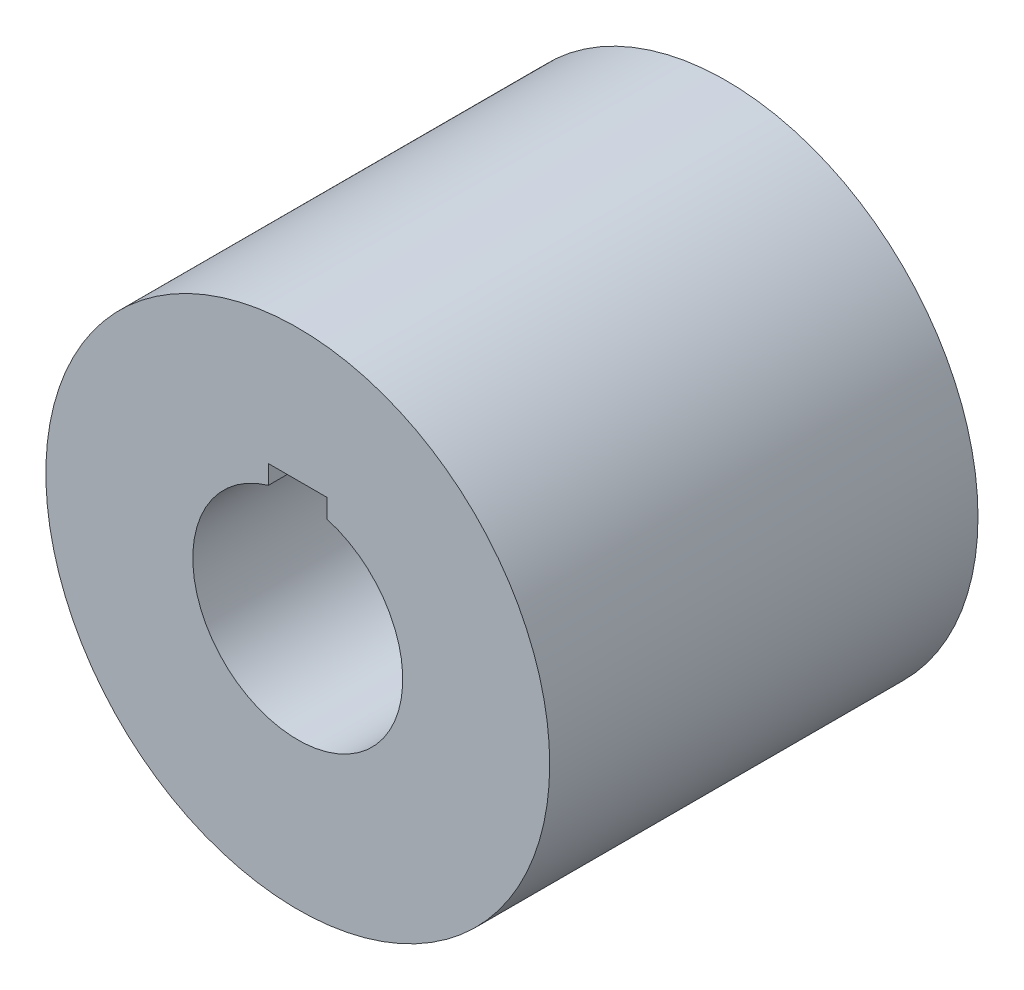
ISO-10303-21;
HEADER;
FILE_DESCRIPTION(('STEP AP214'),'2;1');
FILE_NAME('part.step','',(''),(''),'','','');
FILE_SCHEMA(('AUTOMOTIVE_DESIGN { 1 0 10303 214 1 1 1 1 }'));
ENDSEC;
DATA;
#1=APPLICATION_CONTEXT('core data for automotive mechanical design processes');
#2=APPLICATION_PROTOCOL_DEFINITION('international standard','automotive_design',2000,#1);
#3=PRODUCT_CONTEXT('',#1,'mechanical');
#4=PRODUCT('Part','Part','',(#3));
#5=PRODUCT_RELATED_PRODUCT_CATEGORY('part','',(#4));
#6=PRODUCT_DEFINITION_FORMATION('','',#4);
#7=PRODUCT_DEFINITION_CONTEXT('part definition',#1,'design');
#8=PRODUCT_DEFINITION('design','',#6,#7);
#9=PRODUCT_DEFINITION_SHAPE('','',#8);
#10=(LENGTH_UNIT() NAMED_UNIT(*) SI_UNIT(.MILLI.,.METRE.));
#11=(NAMED_UNIT(*) PLANE_ANGLE_UNIT() SI_UNIT($,.RADIAN.));
#12=(NAMED_UNIT(*) SI_UNIT($,.STERADIAN.) SOLID_ANGLE_UNIT());
#13=UNCERTAINTY_MEASURE_WITH_UNIT(LENGTH_MEASURE(1.E-05),#10,'distance_accuracy_value','');
#14=(GEOMETRIC_REPRESENTATION_CONTEXT(3) GLOBAL_UNCERTAINTY_ASSIGNED_CONTEXT((#13)) GLOBAL_UNIT_ASSIGNED_CONTEXT((#10,
#11,#12)) REPRESENTATION_CONTEXT('',''));
#15=CARTESIAN_POINT('',(0.,0.,0.));
#16=DIRECTION('',(0.,0.,1.));
#17=DIRECTION('',(1.,0.,0.));
#18=AXIS2_PLACEMENT_3D('',#15,#16,#17);
#19=CARTESIAN_POINT('',(0.,0.,51.));
#20=DIRECTION('',(0.,0.,-1.));
#21=DIRECTION('',(-1.,0.,0.));
#22=AXIS2_PLACEMENT_3D('',#19,#20,#21);
#23=CYLINDRICAL_SURFACE('',#22,60.);
#24=CARTESIAN_POINT('',(0.,0.,51.));
#25=DIRECTION('',(0.,0.,1.));
#26=DIRECTION('',(1.,0.,0.));
#27=AXIS2_PLACEMENT_3D('',#24,#25,#26);
#28=CIRCLE('',#27,60.);
#29=CARTESIAN_POINT('',(60.,0.,51.));
#30=VERTEX_POINT('',#29);
#31=EDGE_CURVE('E11',#30,#30,#28,.T.);
#32=ORIENTED_EDGE('',*,*,#31,.F.);
#33=EDGE_LOOP('',(#32));
#34=FACE_BOUND('',#33,.T.);
#35=CARTESIAN_POINT('',(0.,0.,-51.));
#36=DIRECTION('',(0.,0.,1.));
#37=DIRECTION('',(1.,0.,0.));
#38=AXIS2_PLACEMENT_3D('',#35,#36,#37);
#39=CIRCLE('',#38,60.);
#40=CARTESIAN_POINT('',(60.,0.,-51.));
#41=VERTEX_POINT('',#40);
#42=EDGE_CURVE('E42',#41,#41,#39,.T.);
#43=ORIENTED_EDGE('',*,*,#42,.T.);
#44=EDGE_LOOP('',(#43));
#45=FACE_BOUND('',#44,.T.);
#46=ADVANCED_FACE('F35',(#34,#45),#23,.T.);
#47=CARTESIAN_POINT('',(0.,0.,51.));
#48=DIRECTION('',(0.,0.,1.));
#49=DIRECTION('',(1.,0.,0.));
#50=AXIS2_PLACEMENT_3D('',#47,#48,#49);
#51=PLANE('',#50);
#52=DIRECTION('',(0.,1.,0.));
#53=VECTOR('',#52,1.);
#54=CARTESIAN_POINT('',(7.,28.5,51.));
#55=LINE('',#54,#53);
#56=CARTESIAN_POINT('',(7.00000000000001,24.,51.));
#57=VERTEX_POINT('',#56);
#58=CARTESIAN_POINT('',(7.,28.5,51.));
#59=VERTEX_POINT('',#58);
#60=EDGE_CURVE('E49',#57,#59,#55,.T.);
#61=ORIENTED_EDGE('',*,*,#60,.F.);
#62=CARTESIAN_POINT('',(0.,0.,51.));
#63=DIRECTION('',(0.,0.,1.));
#64=DIRECTION('',(1.,0.,0.));
#65=AXIS2_PLACEMENT_3D('',#62,#63,#64);
#66=CIRCLE('',#65,25.);
#67=CARTESIAN_POINT('',(-7.,24.,51.));
#68=VERTEX_POINT('',#67);
#69=EDGE_CURVE('E93',#68,#57,#66,.T.);
#70=ORIENTED_EDGE('',*,*,#69,.F.);
#71=DIRECTION('',(0.,-1.,0.));
#72=VECTOR('',#71,1.);
#73=CARTESIAN_POINT('',(-7.,28.5,51.));
#74=LINE('',#73,#72);
#75=CARTESIAN_POINT('',(-7.,28.5,51.));
#76=VERTEX_POINT('',#75);
#77=EDGE_CURVE('E77',#76,#68,#74,.T.);
#78=ORIENTED_EDGE('',*,*,#77,.F.);
#79=DIRECTION('',(-1.,0.,0.));
#80=VECTOR('',#79,1.);
#81=CARTESIAN_POINT('',(7.,28.5,51.));
#82=LINE('',#81,#80);
#83=EDGE_CURVE('E86',#59,#76,#82,.T.);
#84=ORIENTED_EDGE('',*,*,#83,.F.);
#85=EDGE_LOOP('',(#61,#70,#78,#84));
#86=FACE_BOUND('',#85,.T.);
#87=ORIENTED_EDGE('',*,*,#31,.T.);
#88=EDGE_LOOP('',(#87));
#89=FACE_BOUND('',#88,.T.);
#90=ADVANCED_FACE('F90',(#86,#89),#51,.T.);
#91=CARTESIAN_POINT('',(0.,0.,-51.));
#92=DIRECTION('',(0.,0.,1.));
#93=DIRECTION('',(1.,0.,0.));
#94=AXIS2_PLACEMENT_3D('',#91,#92,#93);
#95=PLANE('',#94);
#96=CARTESIAN_POINT('',(0.,0.,-51.));
#97=DIRECTION('',(0.,0.,1.));
#98=DIRECTION('',(1.,0.,0.));
#99=AXIS2_PLACEMENT_3D('',#96,#97,#98);
#100=CIRCLE('',#99,25.);
#101=CARTESIAN_POINT('',(-7.,24.,-51.));
#102=VERTEX_POINT('',#101);
#103=CARTESIAN_POINT('',(7.00000000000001,24.,-51.));
#104=VERTEX_POINT('',#103);
#105=EDGE_CURVE('E104',#102,#104,#100,.T.);
#106=ORIENTED_EDGE('',*,*,#105,.T.);
#107=DIRECTION('',(0.,1.,0.));
#108=VECTOR('',#107,1.);
#109=CARTESIAN_POINT('',(7.,28.5,-51.));
#110=LINE('',#109,#108);
#111=CARTESIAN_POINT('',(7.,28.5,-51.));
#112=VERTEX_POINT('',#111);
#113=EDGE_CURVE('E95',#104,#112,#110,.T.);
#114=ORIENTED_EDGE('',*,*,#113,.T.);
#115=DIRECTION('',(-1.,0.,0.));
#116=VECTOR('',#115,1.);
#117=CARTESIAN_POINT('',(7.,28.5,-51.));
#118=LINE('',#117,#116);
#119=CARTESIAN_POINT('',(-7.,28.5,-51.));
#120=VERTEX_POINT('',#119);
#121=EDGE_CURVE('E101',#112,#120,#118,.T.);
#122=ORIENTED_EDGE('',*,*,#121,.T.);
#123=DIRECTION('',(0.,-1.,0.));
#124=VECTOR('',#123,1.);
#125=CARTESIAN_POINT('',(-7.,28.5,-51.));
#126=LINE('',#125,#124);
#127=EDGE_CURVE('E57',#120,#102,#126,.T.);
#128=ORIENTED_EDGE('',*,*,#127,.T.);
#129=EDGE_LOOP('',(#106,#114,#122,#128));
#130=FACE_BOUND('',#129,.T.);
#131=ORIENTED_EDGE('',*,*,#42,.F.);
#132=EDGE_LOOP('',(#131));
#133=FACE_BOUND('',#132,.T.);
#134=ADVANCED_FACE('F114',(#130,#133),#95,.F.);
#135=CARTESIAN_POINT('',(7.,28.5,-51.));
#136=DIRECTION('',(1.,0.,0.));
#137=DIRECTION('',(0.,1.,0.));
#138=AXIS2_PLACEMENT_3D('',#135,#136,#137);
#139=PLANE('',#138);
#140=ORIENTED_EDGE('',*,*,#60,.T.);
#141=DIRECTION('',(0.,0.,1.));
#142=VECTOR('',#141,1.);
#143=CARTESIAN_POINT('',(7.,28.5,-51.));
#144=LINE('',#143,#142);
#145=EDGE_CURVE('E83',#112,#59,#144,.T.);
#146=ORIENTED_EDGE('',*,*,#145,.F.);
#147=ORIENTED_EDGE('',*,*,#113,.F.);
#148=DIRECTION('',(0.,0.,1.));
#149=VECTOR('',#148,1.);
#150=CARTESIAN_POINT('',(7.00000000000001,24.,-51.));
#151=LINE('',#150,#149);
#152=EDGE_CURVE('E107',#104,#57,#151,.T.);
#153=ORIENTED_EDGE('',*,*,#152,.T.);
#154=EDGE_LOOP('',(#140,#146,#147,#153));
#155=FACE_BOUND('',#154,.T.);
#156=ADVANCED_FACE('F116',(#155),#139,.F.);
#157=CARTESIAN_POINT('',(0.,0.,-51.));
#158=DIRECTION('',(0.,0.,1.));
#159=DIRECTION('',(1.,0.,0.));
#160=AXIS2_PLACEMENT_3D('',#157,#158,#159);
#161=CYLINDRICAL_SURFACE('',#160,25.);
#162=ORIENTED_EDGE('',*,*,#69,.T.);
#163=ORIENTED_EDGE('',*,*,#152,.F.);
#164=ORIENTED_EDGE('',*,*,#105,.F.);
#165=DIRECTION('',(0.,0.,1.));
#166=VECTOR('',#165,1.);
#167=CARTESIAN_POINT('',(-7.,24.,-51.));
#168=LINE('',#167,#166);
#169=EDGE_CURVE('E82',#102,#68,#168,.T.);
#170=ORIENTED_EDGE('',*,*,#169,.T.);
#171=EDGE_LOOP('',(#162,#163,#164,#170));
#172=FACE_BOUND('',#171,.T.);
#173=ADVANCED_FACE('F123',(#172),#161,.F.);
#174=CARTESIAN_POINT('',(-7.,28.5,-51.));
#175=DIRECTION('',(-1.,0.,0.));
#176=DIRECTION('',(0.,-1.,0.));
#177=AXIS2_PLACEMENT_3D('',#174,#175,#176);
#178=PLANE('',#177);
#179=ORIENTED_EDGE('',*,*,#77,.T.);
#180=ORIENTED_EDGE('',*,*,#169,.F.);
#181=ORIENTED_EDGE('',*,*,#127,.F.);
#182=DIRECTION('',(0.,0.,1.));
#183=VECTOR('',#182,1.);
#184=CARTESIAN_POINT('',(-7.,28.5,-51.));
#185=LINE('',#184,#183);
#186=EDGE_CURVE('E73',#120,#76,#185,.T.);
#187=ORIENTED_EDGE('',*,*,#186,.T.);
#188=EDGE_LOOP('',(#179,#180,#181,#187));
#189=FACE_BOUND('',#188,.T.);
#190=ADVANCED_FACE('F75',(#189),#178,.F.);
#191=CARTESIAN_POINT('',(7.,28.5,-51.));
#192=DIRECTION('',(0.,1.,0.));
#193=DIRECTION('',(0.,0.,1.));
#194=AXIS2_PLACEMENT_3D('',#191,#192,#193);
#195=PLANE('',#194);
#196=ORIENTED_EDGE('',*,*,#83,.T.);
#197=ORIENTED_EDGE('',*,*,#186,.F.);
#198=ORIENTED_EDGE('',*,*,#121,.F.);
#199=ORIENTED_EDGE('',*,*,#145,.T.);
#200=EDGE_LOOP('',(#196,#197,#198,#199));
#201=FACE_BOUND('',#200,.T.);
#202=ADVANCED_FACE('F87',(#201),#195,.F.);
#203=CLOSED_SHELL('',(#46,#90,#134,#156,#173,#190,#202));
#204=MANIFOLD_SOLID_BREP('B2',#203);
#205=ADVANCED_BREP_SHAPE_REPRESENTATION('',(#18,#204),#14);
#206=SHAPE_DEFINITION_REPRESENTATION(#9,#205);
ENDSEC;
END-ISO-10303-21;
